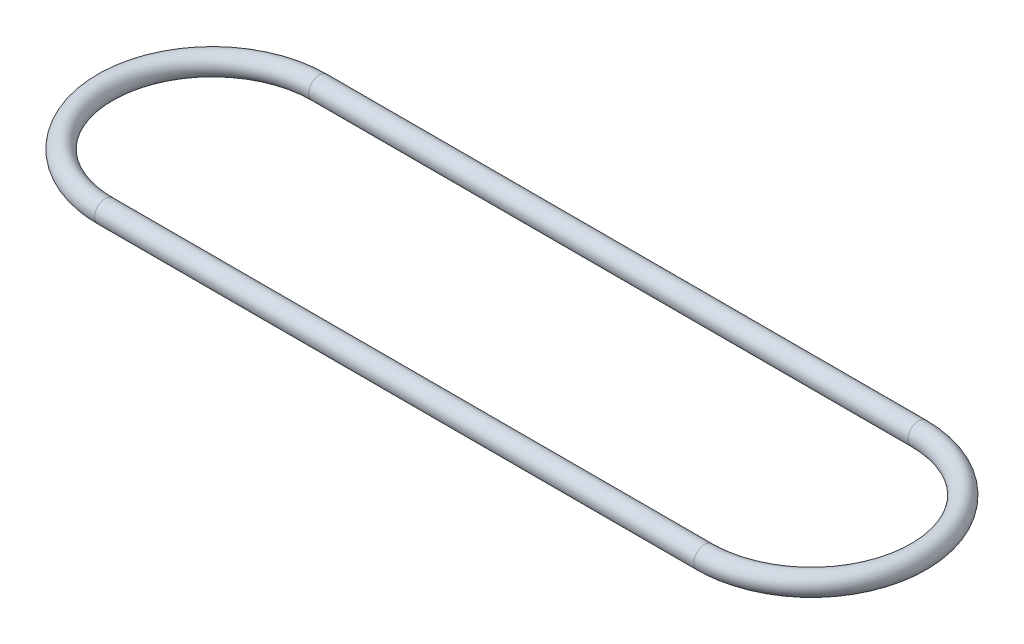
ISO-10303-21;
HEADER;
FILE_DESCRIPTION(('STEP AP214'),'2;1');
FILE_NAME('part.step','',(''),(''),'','','');
FILE_SCHEMA(('AUTOMOTIVE_DESIGN { 1 0 10303 214 1 1 1 1 }'));
ENDSEC;
DATA;
#1=APPLICATION_CONTEXT('core data for automotive mechanical design processes');
#2=APPLICATION_PROTOCOL_DEFINITION('international standard','automotive_design',2000,#1);
#3=PRODUCT_CONTEXT('',#1,'mechanical');
#4=PRODUCT('Part','Part','',(#3));
#5=PRODUCT_RELATED_PRODUCT_CATEGORY('part','',(#4));
#6=PRODUCT_DEFINITION_FORMATION('','',#4);
#7=PRODUCT_DEFINITION_CONTEXT('part definition',#1,'design');
#8=PRODUCT_DEFINITION('design','',#6,#7);
#9=PRODUCT_DEFINITION_SHAPE('','',#8);
#10=(LENGTH_UNIT() NAMED_UNIT(*) SI_UNIT(.MILLI.,.METRE.));
#11=(NAMED_UNIT(*) PLANE_ANGLE_UNIT() SI_UNIT($,.RADIAN.));
#12=(NAMED_UNIT(*) SI_UNIT($,.STERADIAN.) SOLID_ANGLE_UNIT());
#13=UNCERTAINTY_MEASURE_WITH_UNIT(LENGTH_MEASURE(1.E-05),#10,'distance_accuracy_value','');
#14=(GEOMETRIC_REPRESENTATION_CONTEXT(3) GLOBAL_UNCERTAINTY_ASSIGNED_CONTEXT((#13)) GLOBAL_UNIT_ASSIGNED_CONTEXT((#10,
#11,#12)) REPRESENTATION_CONTEXT('',''));
#15=CARTESIAN_POINT('',(0.,0.,0.));
#16=DIRECTION('',(0.,0.,1.));
#17=DIRECTION('',(1.,0.,0.));
#18=AXIS2_PLACEMENT_3D('',#15,#16,#17);
#19=CARTESIAN_POINT('',(140.,0.,25.));
#20=DIRECTION('',(-1.,0.,0.));
#21=DIRECTION('',(0.,0.,1.));
#22=AXIS2_PLACEMENT_3D('',#19,#20,#21);
#23=CYLINDRICAL_SURFACE('',#22,2.5);
#24=CARTESIAN_POINT('',(0.,0.,25.));
#25=DIRECTION('',(1.,0.,0.));
#26=DIRECTION('',(0.,0.,1.));
#27=AXIS2_PLACEMENT_3D('',#24,#25,#26);
#28=CIRCLE('',#27,2.5);
#29=CARTESIAN_POINT('',(0.,0.,27.5));
#30=VERTEX_POINT('',#29);
#31=EDGE_CURVE('E18',#30,#30,#28,.F.);
#32=ORIENTED_EDGE('',*,*,#31,.F.);
#33=EDGE_LOOP('',(#32));
#34=FACE_BOUND('',#33,.T.);
#35=CARTESIAN_POINT('',(140.,0.,25.));
#36=DIRECTION('',(-1.,0.,0.));
#37=DIRECTION('',(0.,0.,1.));
#38=AXIS2_PLACEMENT_3D('',#35,#36,#37);
#39=CIRCLE('',#38,2.5);
#40=CARTESIAN_POINT('',(140.,0.,27.5));
#41=VERTEX_POINT('',#40);
#42=EDGE_CURVE('E27',#41,#41,#39,.F.);
#43=ORIENTED_EDGE('',*,*,#42,.F.);
#44=EDGE_LOOP('',(#43));
#45=FACE_BOUND('',#44,.T.);
#46=ADVANCED_FACE('F15',(#34,#45),#23,.T.);
#47=CARTESIAN_POINT('',(0.,0.,0.));
#48=DIRECTION('',(0.,1.,0.));
#49=DIRECTION('',(0.,0.,1.));
#50=AXIS2_PLACEMENT_3D('',#47,#48,#49);
#51=TOROIDAL_SURFACE('',#50,25.,2.5);
#52=ORIENTED_EDGE('',*,*,#31,.T.);
#53=EDGE_LOOP('',(#52));
#54=FACE_BOUND('',#53,.T.);
#55=CARTESIAN_POINT('',(0.,0.,-25.));
#56=DIRECTION('',(1.,0.,0.));
#57=DIRECTION('',(0.,0.,-1.));
#58=AXIS2_PLACEMENT_3D('',#55,#56,#57);
#59=CIRCLE('',#58,2.5);
#60=CARTESIAN_POINT('',(0.,0.,-27.5));
#61=VERTEX_POINT('',#60);
#62=EDGE_CURVE('E22',#61,#61,#59,.T.);
#63=ORIENTED_EDGE('',*,*,#62,.F.);
#64=EDGE_LOOP('',(#63));
#65=FACE_BOUND('',#64,.T.);
#66=ADVANCED_FACE('F37',(#54,#65),#51,.T.);
#67=CARTESIAN_POINT('',(140.,0.,0.));
#68=DIRECTION('',(0.,-1.,0.));
#69=DIRECTION('',(0.,0.,-1.));
#70=AXIS2_PLACEMENT_3D('',#67,#68,#69);
#71=TOROIDAL_SURFACE('',#70,25.,2.5);
#72=CARTESIAN_POINT('',(140.,0.,-25.));
#73=DIRECTION('',(1.,0.,0.));
#74=DIRECTION('',(0.,0.,-1.));
#75=AXIS2_PLACEMENT_3D('',#72,#73,#74);
#76=CIRCLE('',#75,2.5);
#77=CARTESIAN_POINT('',(140.,0.,-27.5));
#78=VERTEX_POINT('',#77);
#79=EDGE_CURVE('E10',#78,#78,#76,.F.);
#80=ORIENTED_EDGE('',*,*,#79,.F.);
#81=EDGE_LOOP('',(#80));
#82=FACE_BOUND('',#81,.T.);
#83=ORIENTED_EDGE('',*,*,#42,.T.);
#84=EDGE_LOOP('',(#83));
#85=FACE_BOUND('',#84,.T.);
#86=ADVANCED_FACE('F33',(#82,#85),#71,.T.);
#87=CARTESIAN_POINT('',(0.,0.,-25.));
#88=DIRECTION('',(1.,0.,0.));
#89=DIRECTION('',(0.,0.,-1.));
#90=AXIS2_PLACEMENT_3D('',#87,#88,#89);
#91=CYLINDRICAL_SURFACE('',#90,2.5);
#92=ORIENTED_EDGE('',*,*,#79,.T.);
#93=EDGE_LOOP('',(#92));
#94=FACE_BOUND('',#93,.T.);
#95=ORIENTED_EDGE('',*,*,#62,.T.);
#96=EDGE_LOOP('',(#95));
#97=FACE_BOUND('',#96,.T.);
#98=ADVANCED_FACE('F36',(#94,#97),#91,.T.);
#99=CLOSED_SHELL('',(#46,#66,#86,#98));
#100=MANIFOLD_SOLID_BREP('B1',#99);
#101=ADVANCED_BREP_SHAPE_REPRESENTATION('',(#18,#100),#14);
#102=SHAPE_DEFINITION_REPRESENTATION(#9,#101);
ENDSEC;
END-ISO-10303-21;
